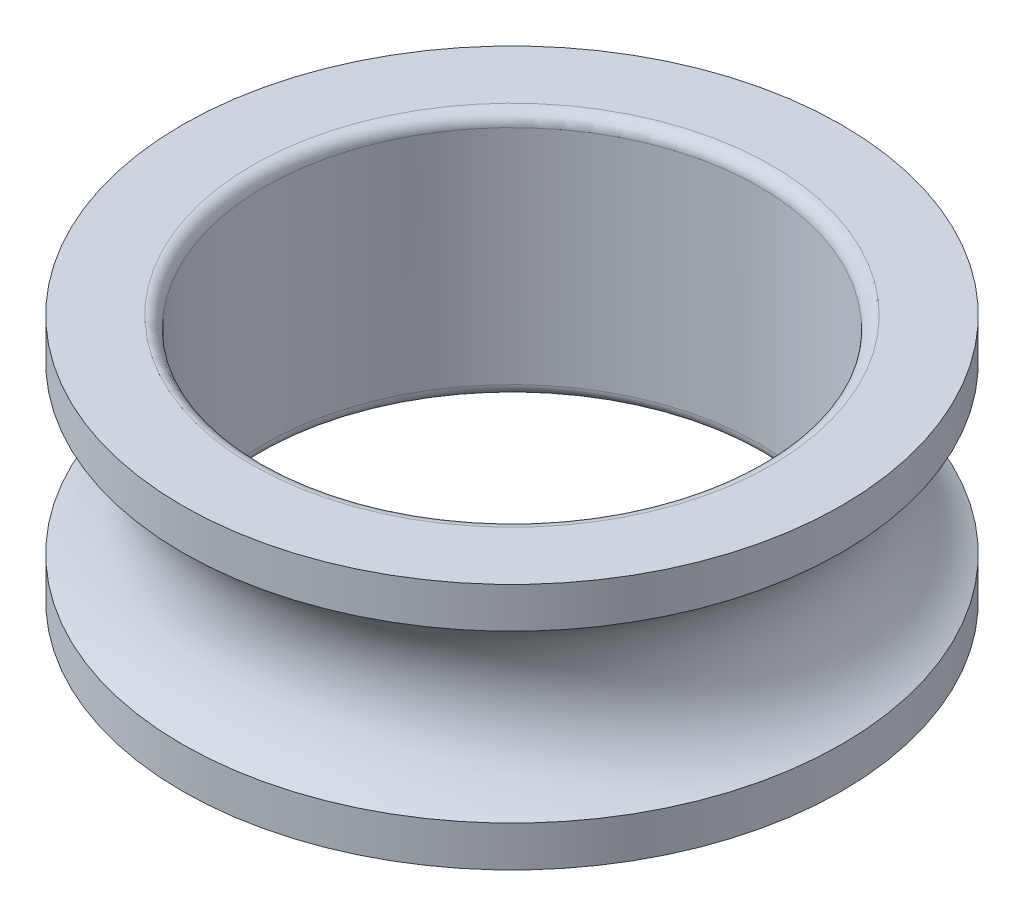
from build123d import *

# Parameters (mm, degrees)
CONG_1_R = 0.3


with BuildPart() as part:
    # Esquisse1 → R_volution1 (revolve)
    with BuildSketch(Plane(origin=(0, 0, 0), x_dir=(-1, 0, 0), z_dir=(0, 0, -1)), mode=Mode.PRIVATE) as r_volution1_sk:
        with BuildLine():
            Line((-8, -3), (-6, -3))
            Line((-6, -3), (-6, 3))
            Line((-6, 3), (-8, 3))
            Line((-8, 3), (-8, 2.015564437))
            ThreePointArc((-8, 2.015564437), (-6.75, 0), (-8, -2.015564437))
            Line((-8, -2.015564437), (-8, -3))
        make_face()
    revolve(r_volution1_sk.sketch.rotate(Axis((0, -3, 0), (0, 1, 0)), 270), axis=Axis((0, -3, 0), (0, 1, 0)))

    # Cong_1
    cong_1_edges = [part.edges().sort_by_distance(p)[0] for p in [
        (0, -3, -6),
        (0, 3, -6),
    ]]
    fillet(cong_1_edges, radius=CONG_1_R)


solid = part.part
